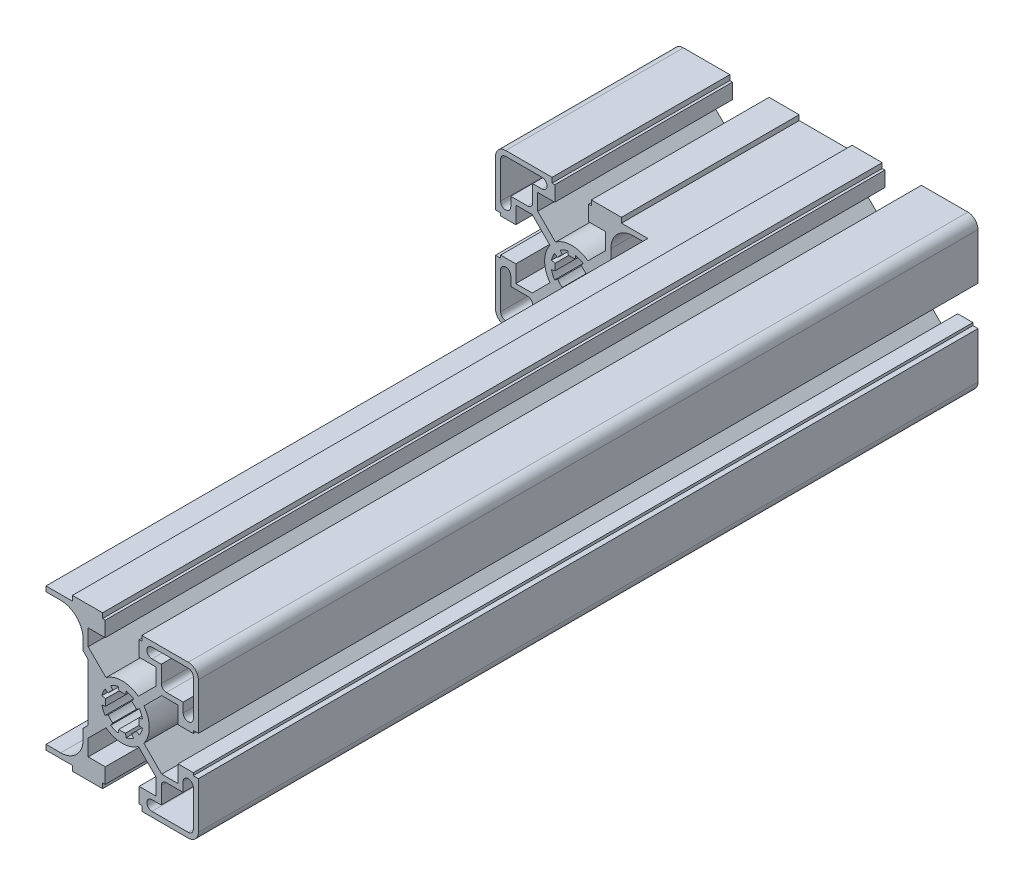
from build123d import *

# Parameters (mm, degrees)
BOSS_EXTRUDE1_DEPTH = 115.1509
SKETCH2_W           = 45.0088
SKETCH2_H           = 45.0088
CUT_EXTRUDE1_DEPTH  = 177.8


with BuildPart() as part:
    # Sketch1 → Boss-Extrude1 (new, symmetric)
    with BuildSketch(Plane.XY):
        with BuildLine():
            Line((-42.0116, 22.5044), (-28.2956, 22.5044))
            Line((-28.2956, 22.5044), (-28.2956, 21.0058))
            Line((-28.2956, 21.0058), (-27.5082, 21.0058))
            Line((-27.5082, 21.0058), (-27.5082, 16.51))
            Line((-27.5082, 16.51), (-32.5501, 16.51))
            Line((-32.5501, 16.51), (-32.5501, 11.680106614))
            Line((-32.5501, 11.680106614), (-27.285426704, 6.415433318))
            ThreePointArc((-27.285426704, 6.415433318), (-22.5044, 8.001), (-17.723373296, 6.415433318))
            Line((-17.723373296, 6.415433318), (-12.4587, 11.680106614))
            Line((-12.4587, 11.680106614), (-12.4587, 16.51))
            Line((-12.4587, 16.51), (-17.5006, 16.51))
            Line((-17.5006, 16.51), (-17.5006, 21.0058))
            Line((-17.5006, 21.0058), (-16.7132, 21.0058))
            Line((-16.7132, 21.0058), (-16.7132, 22.5044))
            Line((-16.7132, 22.5044), (-7.8105, 22.5044))
            Line((-7.8105, 22.5044), (-7.8105, 21.0058))
            Line((-7.8105, 21.0058), (7.8105, 21.0058))
            Line((7.8105, 21.0058), (7.8105, 22.5044))
            Line((7.8105, 22.5044), (16.7132, 22.5044))
            Line((16.7132, 22.5044), (16.7132, 21.0058))
            Line((16.7132, 21.0058), (17.5006, 21.0058))
            Line((17.5006, 21.0058), (17.5006, 16.51))
            Line((17.5006, 16.51), (12.4587, 16.51))
            Line((12.4587, 16.51), (12.4587, 11.680106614))
            Line((12.4587, 11.680106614), (17.723373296, 6.415433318))
            ThreePointArc((17.723373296, 6.415433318), (22.5044, 8.001), (27.285426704, 6.415433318))
            Line((27.285426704, 6.415433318), (32.5501, 11.680106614))
            Line((32.5501, 11.680106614), (32.5501, 16.51))
            Line((32.5501, 16.51), (27.5082, 16.51))
            Line((27.5082, 16.51), (27.5082, 21.0058))
            Line((27.5082, 21.0058), (28.2956, 21.0058))
            Line((28.2956, 21.0058), (28.2956, 22.5044))
            Line((28.2956, 22.5044), (42.0116, 22.5044))
            ThreePointArc((42.0116, 22.5044), (44.130940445, 21.626540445), (45.0088, 19.5072))
            Line((45.0088, 19.5072), (45.0088, 5.7912))
            Line((45.0088, 5.7912), (43.5102, 5.7912))
            Line((43.5102, 5.7912), (43.5102, 5.0038))
            Line((43.5102, 5.0038), (39.0144, 5.0038))
            Line((39.0144, 5.0038), (39.0144, 10.0457))
            Line((39.0144, 10.0457), (34.184506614, 10.0457))
            Line((34.184506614, 10.0457), (28.919833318, 4.781026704))
            ThreePointArc((28.919833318, 4.781026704), (30.5054, 0), (28.919833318, -4.781026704))
            Line((28.919833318, -4.781026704), (34.184506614, -10.0457))
            Line((34.184506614, -10.0457), (39.0144, -10.0457))
            Line((39.0144, -10.0457), (39.0144, -5.0038))
            Line((39.0144, -5.0038), (43.5102, -5.0038))
            Line((43.5102, -5.0038), (43.5102, -5.7912))
            Line((43.5102, -5.7912), (45.0088, -5.7912))
            Line((45.0088, -5.7912), (45.0088, -19.5072))
            ThreePointArc((45.0088, -19.5072), (44.130940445, -21.626540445), (42.0116, -22.5044))
            Line((42.0116, -22.5044), (28.2956, -22.5044))
            Line((28.2956, -22.5044), (28.2956, -21.0058))
            Line((28.2956, -21.0058), (27.5082, -21.0058))
            Line((27.5082, -21.0058), (27.5082, -16.51))
            Line((27.5082, -16.51), (32.5501, -16.51))
            Line((32.5501, -16.51), (32.5501, -11.680106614))
            Line((32.5501, -11.680106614), (27.285426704, -6.415433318))
            ThreePointArc((27.285426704, -6.415433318), (22.5044, -8.001), (17.723373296, -6.415433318))
            Line((17.723373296, -6.415433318), (12.4587, -11.680106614))
            Line((12.4587, -11.680106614), (12.4587, -16.51))
            Line((12.4587, -16.51), (17.5006, -16.51))
            Line((17.5006, -16.51), (17.5006, -21.0058))
            Line((17.5006, -21.0058), (16.7132, -21.0058))
            Line((16.7132, -21.0058), (16.7132, -22.5044))
            Line((16.7132, -22.5044), (7.8105, -22.5044))
            Line((7.8105, -22.5044), (7.8105, -21.0058))
            Line((7.8105, -21.0058), (-7.8105, -21.0058))
            Line((-7.8105, -21.0058), (-7.8105, -22.5044))
            Line((-7.8105, -22.5044), (-16.7132, -22.5044))
            Line((-16.7132, -22.5044), (-16.7132, -21.0058))
            Line((-16.7132, -21.0058), (-17.5006, -21.0058))
            Line((-17.5006, -21.0058), (-17.5006, -16.51))
            Line((-17.5006, -16.51), (-12.4587, -16.51))
            Line((-12.4587, -16.51), (-12.4587, -11.680106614))
            Line((-12.4587, -11.680106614), (-17.723373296, -6.415433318))
            ThreePointArc((-17.723373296, -6.415433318), (-22.5044, -8.001), (-27.285426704, -6.415433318))
            Line((-27.285426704, -6.415433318), (-32.5501, -11.680106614))
            Line((-32.5501, -11.680106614), (-32.5501, -16.51))
            Line((-32.5501, -16.51), (-27.5082, -16.51))
            Line((-27.5082, -16.51), (-27.5082, -21.0058))
            Line((-27.5082, -21.0058), (-28.2956, -21.0058))
            Line((-28.2956, -21.0058), (-28.2956, -22.5044))
            Line((-28.2956, -22.5044), (-42.0116, -22.5044))
            ThreePointArc((-42.0116, -22.5044), (-44.130940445, -21.626540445), (-45.0088, -19.5072))
            Line((-45.0088, -19.5072), (-45.0088, -5.7912))
            Line((-45.0088, -5.7912), (-43.5102, -5.7912))
            Line((-43.5102, -5.7912), (-43.5102, -5.0038))
            Line((-43.5102, -5.0038), (-39.0144, -5.0038))
            Line((-39.0144, -5.0038), (-39.0144, -10.0457))
            Line((-39.0144, -10.0457), (-34.184506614, -10.0457))
            Line((-34.184506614, -10.0457), (-28.919833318, -4.781026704))
            ThreePointArc((-28.919833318, -4.781026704), (-30.5054, 0), (-28.919833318, 4.781026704))
            Line((-28.919833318, 4.781026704), (-34.184506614, 10.0457))
            Line((-34.184506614, 10.0457), (-39.0144, 10.0457))
            Line((-39.0144, 10.0457), (-39.0144, 5.0038))
            Line((-39.0144, 5.0038), (-43.5102, 5.0038))
            Line((-43.5102, 5.0038), (-43.5102, 5.7912))
            Line((-43.5102, 5.7912), (-45.0088, 5.7912))
            Line((-45.0088, 5.7912), (-45.0088, 19.5072))
            ThreePointArc((-45.0088, 19.5072), (-44.130940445, 21.626540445), (-42.0116, 22.5044))
        make_face()
        with BuildLine():
            Line((-40.513, 11.5443), (-35.5473, 11.5443))
            ThreePointArc((-35.5473, 11.5443), (-34.487629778, 11.983229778), (-34.0487, 13.0429))
            Line((-34.0487, 13.0429), (-34.0487, 18.0086))
            Line((-34.0487, 18.0086), (-31.2928, 18.0086))
            ThreePointArc((-31.2928, 18.0086), (-29.7942, 19.5072), (-31.2928, 21.0058))
            Line((-31.2928, 21.0058), (-42.0116, 21.0058))
            ThreePointArc((-42.0116, 21.0058), (-43.071270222, 20.566870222), (-43.5102, 19.5072))
            Line((-43.5102, 19.5072), (-43.5102, 8.7884))
            ThreePointArc((-43.5102, 8.7884), (-42.0116, 7.2898), (-40.513, 8.7884))
            Line((-40.513, 8.7884), (-40.513, 11.5443))
        make_face(mode=Mode.SUBTRACT)
        with BuildLine():
            Line((-21.315129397, 5.978867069), (-21.528207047, 4.907653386))
            ThreePointArc((-21.528207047, 4.907653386), (-22.5044, 5.0038), (-23.480592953, 4.907653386))
            Line((-23.480592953, 4.907653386), (-23.693670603, 5.978867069))
            ThreePointArc((-23.693670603, 5.978867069), (-24.837238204, 5.63196963), (-25.89115614, 5.068638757))
            Line((-25.89115614, 5.068638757), (-25.284362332, 4.160507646))
            ThreePointArc((-25.284362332, 4.160507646), (-26.042620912, 3.538220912), (-26.664907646, 2.779962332))
            Line((-26.664907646, 2.779962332), (-27.573038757, 3.38675614))
            ThreePointArc((-27.573038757, 3.38675614), (-28.13636963, 2.332838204), (-28.483267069, 1.189270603))
            Line((-28.483267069, 1.189270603), (-27.412053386, 0.976192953))
            ThreePointArc((-27.412053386, 0.976192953), (-27.5082, 0), (-27.412053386, -0.976192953))
            Line((-27.412053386, -0.976192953), (-28.483267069, -1.189270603))
            ThreePointArc((-28.483267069, -1.189270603), (-28.13636963, -2.332838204), (-27.573038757, -3.38675614))
            Line((-27.573038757, -3.38675614), (-26.664907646, -2.779962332))
            ThreePointArc((-26.664907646, -2.779962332), (-26.042620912, -3.538220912), (-25.284362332, -4.160507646))
            Line((-25.284362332, -4.160507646), (-25.89115614, -5.068638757))
            ThreePointArc((-25.89115614, -5.068638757), (-24.837238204, -5.63196963), (-23.693670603, -5.978867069))
            Line((-23.693670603, -5.978867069), (-23.480592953, -4.907653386))
            ThreePointArc((-23.480592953, -4.907653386), (-22.5044, -5.0038), (-21.528207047, -4.907653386))
            Line((-21.528207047, -4.907653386), (-21.315129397, -5.978867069))
            ThreePointArc((-21.315129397, -5.978867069), (-20.171561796, -5.63196963), (-19.11764386, -5.068638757))
            Line((-19.11764386, -5.068638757), (-19.724437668, -4.160507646))
            ThreePointArc((-19.724437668, -4.160507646), (-18.966179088, -3.538220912), (-18.343892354, -2.779962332))
            Line((-18.343892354, -2.779962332), (-17.435761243, -3.38675614))
            ThreePointArc((-17.435761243, -3.38675614), (-16.87243037, -2.332838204), (-16.525532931, -1.189270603))
            Line((-16.525532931, -1.189270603), (-17.596746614, -0.976192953))
            ThreePointArc((-17.596746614, -0.976192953), (-17.5006, 0), (-17.596746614, 0.976192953))
            Line((-17.596746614, 0.976192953), (-16.525532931, 1.189270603))
            ThreePointArc((-16.525532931, 1.189270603), (-16.87243037, 2.332838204), (-17.435761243, 3.38675614))
            Line((-17.435761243, 3.38675614), (-18.343892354, 2.779962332))
            ThreePointArc((-18.343892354, 2.779962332), (-18.966179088, 3.538220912), (-19.724437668, 4.160507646))
            Line((-19.724437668, 4.160507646), (-19.11764386, 5.068638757))
            ThreePointArc((-19.11764386, 5.068638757), (-20.171561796, 5.63196963), (-21.315129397, 5.978867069))
        make_face(mode=Mode.SUBTRACT)
        with BuildLine():
            Line((-10.9601, 9.909893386), (-12.4587, 8.411293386))
            Line((-12.4587, 8.411293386), (-12.4587, -8.411293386))
            Line((-12.4587, -8.411293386), (-10.9601, -9.909893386))
            Line((-10.9601, -9.909893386), (-10.9601, -12.9032))
            ThreePointArc((-10.9601, -12.9032), (-9.025833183, -17.572933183), (-4.3561, -19.5072))
            Line((-4.3561, -19.5072), (4.3561, -19.5072))
            ThreePointArc((4.3561, -19.5072), (9.025833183, -17.572933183), (10.9601, -12.9032))
            Line((10.9601, -12.9032), (10.9601, -9.909893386))
            Line((10.9601, -9.909893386), (12.4587, -8.411293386))
            Line((12.4587, -8.411293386), (12.4587, 8.411293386))
            Line((12.4587, 8.411293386), (10.9601, 9.909893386))
            Line((10.9601, 9.909893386), (10.9601, 12.9032))
            ThreePointArc((10.9601, 12.9032), (9.025833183, 17.572933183), (4.3561, 19.5072))
            Line((4.3561, 19.5072), (-4.3561, 19.5072))
            ThreePointArc((-4.3561, 19.5072), (-9.025833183, 17.572933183), (-10.9601, 12.9032))
            Line((-10.9601, 12.9032), (-10.9601, 9.909893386))
        make_face(mode=Mode.SUBTRACT)
        with BuildLine():
            Line((-40.513, -11.5443), (-35.5473, -11.5443))
            ThreePointArc((-35.5473, -11.5443), (-34.487629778, -11.983229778), (-34.0487, -13.0429))
            Line((-34.0487, -13.0429), (-34.0487, -18.0086))
            Line((-34.0487, -18.0086), (-31.2928, -18.0086))
            ThreePointArc((-31.2928, -18.0086), (-29.7942, -19.5072), (-31.2928, -21.0058))
            Line((-31.2928, -21.0058), (-42.0116, -21.0058))
            ThreePointArc((-42.0116, -21.0058), (-43.071270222, -20.566870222), (-43.5102, -19.5072))
            Line((-43.5102, -19.5072), (-43.5102, -8.7884))
            ThreePointArc((-43.5102, -8.7884), (-42.0116, -7.2898), (-40.513, -8.7884))
            Line((-40.513, -8.7884), (-40.513, -11.5443))
        make_face(mode=Mode.SUBTRACT)
        with BuildLine():
            Line((42.0116, 21.0058), (31.2928, 21.0058))
            ThreePointArc((31.2928, 21.0058), (29.7942, 19.5072), (31.2928, 18.0086))
            Line((31.2928, 18.0086), (34.0487, 18.0086))
            Line((34.0487, 18.0086), (34.0487, 13.0429))
            ThreePointArc((34.0487, 13.0429), (34.487629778, 11.983229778), (35.5473, 11.5443))
            Line((35.5473, 11.5443), (40.513, 11.5443))
            Line((40.513, 11.5443), (40.513, 8.7884))
            ThreePointArc((40.513, 8.7884), (42.0116, 7.2898), (43.5102, 8.7884))
            Line((43.5102, 8.7884), (43.5102, 19.5072))
            ThreePointArc((43.5102, 19.5072), (43.071270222, 20.566870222), (42.0116, 21.0058))
        make_face(mode=Mode.SUBTRACT)
        with BuildLine():
            Line((40.513, -11.5443), (35.5473, -11.5443))
            ThreePointArc((35.5473, -11.5443), (34.487629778, -11.983229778), (34.0487, -13.0429))
            Line((34.0487, -13.0429), (34.0487, -18.0086))
            Line((34.0487, -18.0086), (31.2928, -18.0086))
            ThreePointArc((31.2928, -18.0086), (29.7942, -19.5072), (31.2928, -21.0058))
            Line((31.2928, -21.0058), (42.0116, -21.0058))
            ThreePointArc((42.0116, -21.0058), (43.071270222, -20.566870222), (43.5102, -19.5072))
            Line((43.5102, -19.5072), (43.5102, -8.7884))
            ThreePointArc((43.5102, -8.7884), (42.0116, -7.2898), (40.513, -8.7884))
            Line((40.513, -8.7884), (40.513, -11.5443))
        make_face(mode=Mode.SUBTRACT)
        with BuildLine():
            Line((27.573038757, 3.38675614), (26.664907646, 2.779962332))
            ThreePointArc((26.664907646, 2.779962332), (26.042620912, 3.538220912), (25.284362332, 4.160507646))
            Line((25.284362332, 4.160507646), (25.89115614, 5.068638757))
            ThreePointArc((25.89115614, 5.068638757), (24.837238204, 5.63196963), (23.693670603, 5.978867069))
            Line((23.693670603, 5.978867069), (23.480592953, 4.907653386))
            ThreePointArc((23.480592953, 4.907653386), (22.5044, 5.0038), (21.528207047, 4.907653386))
            Line((21.528207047, 4.907653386), (21.315129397, 5.978867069))
            ThreePointArc((21.315129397, 5.978867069), (20.171561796, 5.63196963), (19.11764386, 5.068638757))
            Line((19.11764386, 5.068638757), (19.724437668, 4.160507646))
            ThreePointArc((19.724437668, 4.160507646), (18.966179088, 3.538220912), (18.343892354, 2.779962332))
            Line((18.343892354, 2.779962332), (17.435761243, 3.38675614))
            ThreePointArc((17.435761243, 3.38675614), (16.87243037, 2.332838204), (16.525532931, 1.189270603))
            Line((16.525532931, 1.189270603), (17.596746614, 0.976192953))
            ThreePointArc((17.596746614, 0.976192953), (17.5006, 0), (17.596746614, -0.976192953))
            Line((17.596746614, -0.976192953), (16.525532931, -1.189270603))
            ThreePointArc((16.525532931, -1.189270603), (16.87243037, -2.332838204), (17.435761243, -3.38675614))
            Line((17.435761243, -3.38675614), (18.343892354, -2.779962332))
            ThreePointArc((18.343892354, -2.779962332), (18.966179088, -3.538220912), (19.724437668, -4.160507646))
            Line((19.724437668, -4.160507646), (19.11764386, -5.068638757))
            ThreePointArc((19.11764386, -5.068638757), (20.171561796, -5.63196963), (21.315129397, -5.978867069))
            Line((21.315129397, -5.978867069), (21.528207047, -4.907653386))
            ThreePointArc((21.528207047, -4.907653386), (22.5044, -5.0038), (23.480592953, -4.907653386))
            Line((23.480592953, -4.907653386), (23.693670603, -5.978867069))
            ThreePointArc((23.693670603, -5.978867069), (24.837238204, -5.63196963), (25.89115614, -5.068638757))
            Line((25.89115614, -5.068638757), (25.284362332, -4.160507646))
            ThreePointArc((25.284362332, -4.160507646), (26.042620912, -3.538220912), (26.664907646, -2.779962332))
            Line((26.664907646, -2.779962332), (27.573038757, -3.38675614))
            ThreePointArc((27.573038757, -3.38675614), (28.13636963, -2.332838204), (28.483267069, -1.189270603))
            Line((28.483267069, -1.189270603), (27.412053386, -0.976192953))
            ThreePointArc((27.412053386, -0.976192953), (27.5082, 0), (27.412053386, 0.976192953))
            Line((27.412053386, 0.976192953), (28.483267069, 1.189270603))
            ThreePointArc((28.483267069, 1.189270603), (28.13636963, 2.332838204), (27.573038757, 3.38675614))
        make_face(mode=Mode.SUBTRACT)
    extrude(amount=BOSS_EXTRUDE1_DEPTH, both=True)

    # Sketch2 → Cut-Extrude1 (cut)
    with BuildSketch(Plane.XY.offset(115.1509)):
        with Locations((-22.5044, 0)):
            Rectangle(SKETCH2_W, SKETCH2_H)
    extrude(amount=-CUT_EXTRUDE1_DEPTH, mode=Mode.SUBTRACT)


solid = part.part
